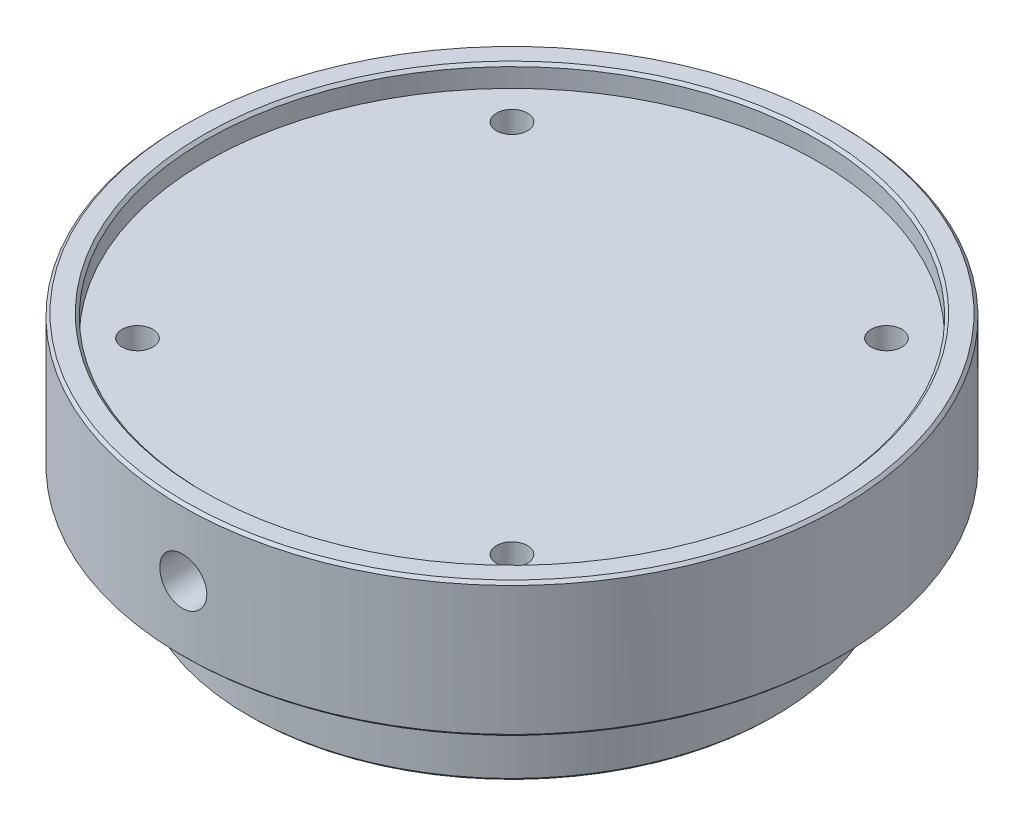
ISO-10303-21;
HEADER;
FILE_DESCRIPTION(('STEP AP214'),'2;1');
FILE_NAME('part.step','',(''),(''),'','','');
FILE_SCHEMA(('AUTOMOTIVE_DESIGN { 1 0 10303 214 1 1 1 1 }'));
ENDSEC;
DATA;
#1=APPLICATION_CONTEXT('core data for automotive mechanical design processes');
#2=APPLICATION_PROTOCOL_DEFINITION('international standard','automotive_design',2000,#1);
#3=PRODUCT_CONTEXT('',#1,'mechanical');
#4=PRODUCT('Part','Part','',(#3));
#5=PRODUCT_RELATED_PRODUCT_CATEGORY('part','',(#4));
#6=PRODUCT_DEFINITION_FORMATION('','',#4);
#7=PRODUCT_DEFINITION_CONTEXT('part definition',#1,'design');
#8=PRODUCT_DEFINITION('design','',#6,#7);
#9=PRODUCT_DEFINITION_SHAPE('','',#8);
#10=(LENGTH_UNIT() NAMED_UNIT(*) SI_UNIT(.MILLI.,.METRE.));
#11=(NAMED_UNIT(*) PLANE_ANGLE_UNIT() SI_UNIT($,.RADIAN.));
#12=(NAMED_UNIT(*) SI_UNIT($,.STERADIAN.) SOLID_ANGLE_UNIT());
#13=UNCERTAINTY_MEASURE_WITH_UNIT(LENGTH_MEASURE(1.E-05),#10,'distance_accuracy_value','');
#14=(GEOMETRIC_REPRESENTATION_CONTEXT(3) GLOBAL_UNCERTAINTY_ASSIGNED_CONTEXT((#13)) GLOBAL_UNIT_ASSIGNED_CONTEXT((#10,
#11,#12)) REPRESENTATION_CONTEXT('',''));
#15=CARTESIAN_POINT('',(0.,0.,0.));
#16=DIRECTION('',(0.,0.,1.));
#17=DIRECTION('',(1.,0.,0.));
#18=AXIS2_PLACEMENT_3D('',#15,#16,#17);
#19=CARTESIAN_POINT('',(35.56,-29.591,0.));
#20=DIRECTION('',(0.,1.,0.));
#21=DIRECTION('',(-1.,0.,0.));
#22=AXIS2_PLACEMENT_3D('',#19,#20,#21);
#23=PLANE('',#22);
#24=CARTESIAN_POINT('',(0.,-29.591,0.));
#25=DIRECTION('',(0.,1.,0.));
#26=DIRECTION('',(-1.,0.,0.));
#27=AXIS2_PLACEMENT_3D('',#24,#25,#26);
#28=CIRCLE('',#27,35.179);
#29=CARTESIAN_POINT('',(-35.179,-29.591,0.));
#30=VERTEX_POINT('',#29);
#31=EDGE_CURVE('E159',#30,#30,#28,.F.);
#32=ORIENTED_EDGE('',*,*,#31,.T.);
#33=EDGE_LOOP('',(#32));
#34=FACE_BOUND('',#33,.T.);
#35=ADVANCED_FACE('F30',(#34),#23,.F.);
#36=CARTESIAN_POINT('',(0.,-2.921,0.));
#37=DIRECTION('',(0.,-1.,0.));
#38=DIRECTION('',(1.,0.,0.));
#39=AXIS2_PLACEMENT_3D('',#36,#37,#38);
#40=PLANE('',#39);
#41=CARTESIAN_POINT('',(-25.256970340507,-2.92100000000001,-25.2569703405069));
#42=DIRECTION('',(0.,1.,0.));
#43=DIRECTION('',(0.,0.,1.));
#44=AXIS2_PLACEMENT_3D('',#41,#42,#43);
#45=CIRCLE('',#44,2.0828);
#46=CARTESIAN_POINT('',(-25.256970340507,-2.92100000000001,-23.1741703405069));
#47=VERTEX_POINT('',#46);
#48=EDGE_CURVE('E96',#47,#47,#45,.T.);
#49=ORIENTED_EDGE('',*,*,#48,.F.);
#50=EDGE_LOOP('',(#49));
#51=FACE_BOUND('',#50,.T.);
#52=CARTESIAN_POINT('',(-25.2569703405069,-2.92100000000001,25.256970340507));
#53=DIRECTION('',(0.,1.,0.));
#54=DIRECTION('',(0.,0.,1.));
#55=AXIS2_PLACEMENT_3D('',#52,#53,#54);
#56=CIRCLE('',#55,2.0828);
#57=CARTESIAN_POINT('',(-25.2569703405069,-2.92100000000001,27.339770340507));
#58=VERTEX_POINT('',#57);
#59=EDGE_CURVE('E108',#58,#58,#56,.T.);
#60=ORIENTED_EDGE('',*,*,#59,.F.);
#61=EDGE_LOOP('',(#60));
#62=FACE_BOUND('',#61,.T.);
#63=CARTESIAN_POINT('',(25.2569703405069,-2.921,-25.2569703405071));
#64=DIRECTION('',(0.,1.,0.));
#65=DIRECTION('',(0.,0.,1.));
#66=AXIS2_PLACEMENT_3D('',#63,#64,#65);
#67=CIRCLE('',#66,2.0828);
#68=CARTESIAN_POINT('',(25.2569703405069,-2.921,-23.1741703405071));
#69=VERTEX_POINT('',#68);
#70=EDGE_CURVE('E120',#69,#69,#67,.T.);
#71=ORIENTED_EDGE('',*,*,#70,.F.);
#72=EDGE_LOOP('',(#71));
#73=FACE_BOUND('',#72,.T.);
#74=CARTESIAN_POINT('',(25.256970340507,-2.921,25.2569703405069));
#75=DIRECTION('',(0.,1.,0.));
#76=DIRECTION('',(0.,0.,1.));
#77=AXIS2_PLACEMENT_3D('',#74,#75,#76);
#78=CIRCLE('',#77,2.0828);
#79=CARTESIAN_POINT('',(25.256970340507,-2.921,27.3397703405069));
#80=VERTEX_POINT('',#79);
#81=EDGE_CURVE('E132',#80,#80,#78,.T.);
#82=ORIENTED_EDGE('',*,*,#81,.F.);
#83=EDGE_LOOP('',(#82));
#84=FACE_BOUND('',#83,.T.);
#85=CARTESIAN_POINT('',(0.,-2.92100000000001,0.));
#86=DIRECTION('',(0.,1.,0.));
#87=DIRECTION('',(-1.,0.,0.));
#88=AXIS2_PLACEMENT_3D('',#85,#86,#87);
#89=CIRCLE('',#88,41.275);
#90=CARTESIAN_POINT('',(-41.275,-2.92100000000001,0.));
#91=VERTEX_POINT('',#90);
#92=EDGE_CURVE('E138',#91,#91,#89,.T.);
#93=ORIENTED_EDGE('',*,*,#92,.T.);
#94=EDGE_LOOP('',(#93));
#95=FACE_BOUND('',#94,.T.);
#96=ADVANCED_FACE('F256',(#51,#62,#73,#84,#95),#40,.F.);
#97=CARTESIAN_POINT('',(0.,0.,0.));
#98=DIRECTION('',(0.,1.,0.));
#99=DIRECTION('',(-1.,0.,0.));
#100=AXIS2_PLACEMENT_3D('',#97,#98,#99);
#101=CYLINDRICAL_SURFACE('',#100,41.275);
#102=CARTESIAN_POINT('',(0.,-0.38099999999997,0.));
#103=DIRECTION('',(0.,-1.,0.));
#104=DIRECTION('',(1.,0.,0.));
#105=AXIS2_PLACEMENT_3D('',#102,#103,#104);
#106=CIRCLE('',#105,41.275);
#107=CARTESIAN_POINT('',(41.275,-0.380999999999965,0.));
#108=VERTEX_POINT('',#107);
#109=EDGE_CURVE('E141',#108,#108,#106,.F.);
#110=ORIENTED_EDGE('',*,*,#109,.T.);
#111=EDGE_LOOP('',(#110));
#112=FACE_BOUND('',#111,.T.);
#113=ORIENTED_EDGE('',*,*,#92,.F.);
#114=EDGE_LOOP('',(#113));
#115=FACE_BOUND('',#114,.T.);
#116=ADVANCED_FACE('F262',(#112,#115),#101,.F.);
#117=CARTESIAN_POINT('',(41.275,0.,0.));
#118=DIRECTION('',(0.,-1.,0.));
#119=DIRECTION('',(1.,0.,0.));
#120=AXIS2_PLACEMENT_3D('',#117,#118,#119);
#121=PLANE('',#120);
#122=CARTESIAN_POINT('',(0.,0.,0.));
#123=DIRECTION('',(0.,-1.,0.));
#124=DIRECTION('',(1.,0.,0.));
#125=AXIS2_PLACEMENT_3D('',#122,#123,#124);
#126=CIRCLE('',#125,41.656);
#127=CARTESIAN_POINT('',(41.656,0.,0.));
#128=VERTEX_POINT('',#127);
#129=EDGE_CURVE('E147',#128,#128,#126,.T.);
#130=ORIENTED_EDGE('',*,*,#129,.T.);
#131=EDGE_LOOP('',(#130));
#132=FACE_BOUND('',#131,.T.);
#133=CARTESIAN_POINT('',(0.,0.,0.));
#134=DIRECTION('',(0.,-1.,0.));
#135=DIRECTION('',(1.,0.,0.));
#136=AXIS2_PLACEMENT_3D('',#133,#134,#135);
#137=CIRCLE('',#136,44.069);
#138=CARTESIAN_POINT('',(44.069,0.,0.));
#139=VERTEX_POINT('',#138);
#140=EDGE_CURVE('E144',#139,#139,#137,.F.);
#141=ORIENTED_EDGE('',*,*,#140,.T.);
#142=EDGE_LOOP('',(#141));
#143=FACE_BOUND('',#142,.T.);
#144=ADVANCED_FACE('F252',(#132,#143),#121,.F.);
#145=CARTESIAN_POINT('',(0.,0.,0.));
#146=DIRECTION('',(0.,1.,0.));
#147=DIRECTION('',(-1.,0.,0.));
#148=AXIS2_PLACEMENT_3D('',#145,#146,#147);
#149=CYLINDRICAL_SURFACE('',#148,44.45);
#150=CARTESIAN_POINT('',(0.,-5.90550000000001,-44.45));
#151=CARTESIAN_POINT('',(-0.178097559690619,-5.90550781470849,-44.4499985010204));
#152=CARTESIAN_POINT('',(-0.356318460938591,-5.92053560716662,-44.4489181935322));
#153=CARTESIAN_POINT('',(-0.707835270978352,-5.98026655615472,-44.4447124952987));
#154=CARTESIAN_POINT('',(-0.88112526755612,-6.02500389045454,-44.4415847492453));
#155=CARTESIAN_POINT('',(-1.21763791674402,-6.14285894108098,-44.4336378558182));
#156=CARTESIAN_POINT('',(-1.38086597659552,-6.21596125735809,-44.4288196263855));
#157=CARTESIAN_POINT('',(-1.69269346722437,-6.38844515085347,-44.418033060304));
#158=CARTESIAN_POINT('',(-1.84129615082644,-6.48782086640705,-44.4120649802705));
#159=CARTESIAN_POINT('',(-2.11997998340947,-6.71023731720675,-44.3996363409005));
#160=CARTESIAN_POINT('',(-2.25002939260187,-6.83331777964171,-44.3931749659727));
#161=CARTESIAN_POINT('',(-2.48764317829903,-7.09956696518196,-44.380494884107));
#162=CARTESIAN_POINT('',(-2.59520659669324,-7.24273654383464,-44.3742761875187));
#163=CARTESIAN_POINT('',(-2.78489768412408,-7.5452858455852,-44.3627762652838));
#164=CARTESIAN_POINT('',(-2.86699822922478,-7.7046826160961,-44.3574960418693));
#165=CARTESIAN_POINT('',(-3.00325964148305,-8.03504240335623,-44.3484793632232));
#166=CARTESIAN_POINT('',(-3.0574208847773,-8.20600526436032,-44.3447428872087));
#167=CARTESIAN_POINT('',(-3.1361761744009,-8.55433219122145,-44.3392430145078));
#168=CARTESIAN_POINT('',(-3.16082095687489,-8.73168473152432,-44.337476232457));
#169=CARTESIAN_POINT('',(-3.180000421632,-9.08801738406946,-44.3361048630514));
#170=CARTESIAN_POINT('',(-3.17453553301,-9.26699747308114,-44.3365002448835));
#171=CARTESIAN_POINT('',(-3.13369280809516,-9.62115815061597,-44.3394054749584));
#172=CARTESIAN_POINT('',(-3.09836996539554,-9.79634511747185,-44.3419114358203));
#173=CARTESIAN_POINT('',(-2.99889937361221,-10.1382970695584,-44.3487493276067));
#174=CARTESIAN_POINT('',(-2.93475140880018,-10.3050619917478,-44.3530812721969));
#175=CARTESIAN_POINT('',(-2.77938940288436,-10.625612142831,-44.3630874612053));
#176=CARTESIAN_POINT('',(-2.68815052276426,-10.7793852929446,-44.3687629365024));
#177=CARTESIAN_POINT('',(-2.4812145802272,-11.0694547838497,-44.3808154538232));
#178=CARTESIAN_POINT('',(-2.36551715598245,-11.2057508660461,-44.3871925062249));
#179=CARTESIAN_POINT('',(-2.11263912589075,-11.4573171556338,-44.3999468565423));
#180=CARTESIAN_POINT('',(-1.97541094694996,-11.572539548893,-44.4063241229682));
#181=CARTESIAN_POINT('',(-1.68353326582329,-11.7783185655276,-44.4183465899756));
#182=CARTESIAN_POINT('',(-1.52888375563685,-11.8688751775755,-44.4239917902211));
#183=CARTESIAN_POINT('',(-1.20652351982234,-12.0227484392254,-44.4339147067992));
#184=CARTESIAN_POINT('',(-1.03881186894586,-12.086063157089,-44.4381923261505));
#185=CARTESIAN_POINT('',(-0.695101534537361,-12.1836228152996,-44.4448968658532));
#186=CARTESIAN_POINT('',(-0.51910297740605,-12.2178681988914,-44.4473238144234));
#187=CARTESIAN_POINT('',(-0.164229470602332,-12.2562575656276,-44.4500499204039));
#188=CARTESIAN_POINT('',(0.0146382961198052,-12.2604676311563,-44.4503537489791));
#189=CARTESIAN_POINT('',(0.370537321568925,-12.2388396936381,-44.4488118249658));
#190=CARTESIAN_POINT('',(0.547568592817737,-12.2130018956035,-44.4469660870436));
#191=CARTESIAN_POINT('',(0.894582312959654,-12.132066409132,-44.4413357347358));
#192=CARTESIAN_POINT('',(1.06457189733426,-12.0769991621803,-44.4375531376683));
#193=CARTESIAN_POINT('',(1.39289741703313,-11.9391989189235,-44.4284743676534));
#194=CARTESIAN_POINT('',(1.55123321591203,-11.8564655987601,-44.423178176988));
#195=CARTESIAN_POINT('',(1.85205847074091,-11.6655143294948,-44.4116551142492));
#196=CARTESIAN_POINT('',(1.99451993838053,-11.5572523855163,-44.4054266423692));
#197=CARTESIAN_POINT('',(2.25927051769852,-11.3183808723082,-44.3927448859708));
#198=CARTESIAN_POINT('',(2.38155937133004,-11.187771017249,-44.3862915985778));
#199=CARTESIAN_POINT('',(2.60271836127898,-10.907625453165,-44.3738738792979));
#200=CARTESIAN_POINT('',(2.70154552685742,-10.7580557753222,-44.3679103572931));
#201=CARTESIAN_POINT('',(2.87268159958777,-10.4444063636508,-44.3571593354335));
#202=CARTESIAN_POINT('',(2.94499071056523,-10.280326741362,-44.3523718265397));
#203=CARTESIAN_POINT('',(3.06096414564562,-9.94247011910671,-44.3445193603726));
#204=CARTESIAN_POINT('',(3.10465522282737,-9.76870234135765,-44.3414527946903));
#205=CARTESIAN_POINT('',(3.16223963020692,-9.41627466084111,-44.3373836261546));
#206=CARTESIAN_POINT('',(3.17613336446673,-9.23761482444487,-44.3363809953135));
#207=CARTESIAN_POINT('',(3.1737245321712,-8.88090165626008,-44.3365534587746));
#208=CARTESIAN_POINT('',(3.15748950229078,-8.7028478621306,-44.3377236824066));
#209=CARTESIAN_POINT('',(3.09542433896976,-8.35200183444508,-44.3420996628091));
#210=CARTESIAN_POINT('',(3.04959415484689,-8.17920960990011,-44.3453054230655));
#211=CARTESIAN_POINT('',(2.92965566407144,-7.8437839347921,-44.353390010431));
#212=CARTESIAN_POINT('',(2.85554804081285,-7.68115023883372,-44.3582687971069));
#213=CARTESIAN_POINT('',(2.6811666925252,-7.37062317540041,-44.3691496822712));
#214=CARTESIAN_POINT('',(2.58089353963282,-7.22272948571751,-44.375151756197));
#215=CARTESIAN_POINT('',(2.35677531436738,-6.94553630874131,-44.3876187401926));
#216=CARTESIAN_POINT('',(2.23288076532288,-6.81627686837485,-44.3940846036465));
#217=CARTESIAN_POINT('',(1.96511570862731,-6.58034220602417,-44.4067421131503));
#218=CARTESIAN_POINT('',(1.82124034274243,-6.47367249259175,-44.412933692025));
#219=CARTESIAN_POINT('',(1.51738984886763,-6.28584173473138,-44.4243532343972));
#220=CARTESIAN_POINT('',(1.35739121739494,-6.20471866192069,-44.429579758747));
#221=CARTESIAN_POINT('',(1.02612043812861,-6.07058916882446,-44.4384621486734));
#222=CARTESIAN_POINT('',(0.854861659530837,-6.01755005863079,-44.4421198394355));
#223=CARTESIAN_POINT('',(0.568807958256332,-5.95477057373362,-44.4465015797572));
#224=CARTESIAN_POINT('',(0.455858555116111,-5.93631826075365,-44.4478076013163));
#225=CARTESIAN_POINT('',(0.228623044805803,-5.9116804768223,-44.4495572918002));
#226=CARTESIAN_POINT('',(0.114336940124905,-5.90549498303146,-44.4500009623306));
#227=CARTESIAN_POINT('',(0.,-5.90550000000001,-44.45));
#228=B_SPLINE_CURVE_WITH_KNOTS('',3,(#150,#151,#152,#153,#154,#155,#156,#157,#158,#159,#160,
#161,#162,#163,#164,#165,#166,#167,#168,#169,#170,#171,#172,#173,#174,#175,#176,#177,#178,#179,
#180,#181,#182,#183,#184,#185,#186,#187,#188,#189,#190,#191,#192,#193,#194,#195,#196,#197,#198,
#199,#200,#201,#202,#203,#204,#205,#206,#207,#208,#209,#210,#211,#212,#213,#214,#215,#216,#217,
#218,#219,#220,#221,#222,#223,#224,#225,#226,#227),.UNSPECIFIED.,.T.,.F.,(4,2,2,2,2,2,2,2,2,2,2,
2,2,2,2,2,2,2,2,2,2,2,2,2,2,2,2,2,2,2,2,2,2,2,2,2,2,2,4),(0.,0.53387525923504,1.06836575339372,
1.60256646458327,2.13664809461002,2.67163271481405,3.20664012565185,3.74221550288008,
4.27778366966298,4.81242991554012,5.34706854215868,5.88072458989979,6.41438463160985,
6.94853549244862,7.48269425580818,8.01805033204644,8.55340665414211,9.08880093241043,
9.62418704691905,10.1583948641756,10.6925990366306,11.2262479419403,11.7599030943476,
12.2944847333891,12.8290732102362,13.3646333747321,13.9001894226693,14.4352440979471,
14.9702915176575,15.5041410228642,16.0379914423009,16.571828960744,17.105654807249,
17.6406113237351,18.1756981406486,18.7115765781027,19.2468298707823,19.5895733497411,
19.9323161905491),.UNSPECIFIED.);
#229=CARTESIAN_POINT('',(0.,-5.90550000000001,-44.45));
#230=VERTEX_POINT('',#229);
#231=EDGE_CURVE('E11',#230,#230,#228,.T.);
#232=ORIENTED_EDGE('',*,*,#231,.T.);
#233=EDGE_LOOP('',(#232));
#234=FACE_BOUND('',#233,.T.);
#235=CARTESIAN_POINT('',(3.175,-9.0805,44.3364621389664));
#236=CARTESIAN_POINT('',(3.17499218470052,-9.25859690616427,44.3364636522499));
#237=CARTESIAN_POINT('',(3.15996449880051,-9.43681715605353,44.3375467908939));
#238=CARTESIAN_POINT('',(3.10023401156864,-9.78833261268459,44.3417626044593));
#239=CARTESIAN_POINT('',(3.05549703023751,-9.96162190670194,44.3448976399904));
#240=CARTESIAN_POINT('',(2.93764301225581,-10.298133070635,44.3528603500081));
#241=CARTESIAN_POINT('',(2.86454139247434,-10.4613603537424,44.3576871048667));
#242=CARTESIAN_POINT('',(2.69205913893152,-10.7731865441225,44.3684882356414));
#243=CARTESIAN_POINT('',(2.5926843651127,-10.9217887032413,44.374462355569));
#244=CARTESIAN_POINT('',(2.37026886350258,-11.2004731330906,44.3868980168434));
#245=CARTESIAN_POINT('',(2.24718819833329,-11.3305234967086,44.3933603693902));
#246=CARTESIAN_POINT('',(1.98093820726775,-11.5681391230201,44.4060368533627));
#247=CARTESIAN_POINT('',(1.83776802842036,-11.6757034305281,44.4122509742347));
#248=CARTESIAN_POINT('',(1.53521820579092,-11.8653954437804,44.4237381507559));
#249=CARTESIAN_POINT('',(1.37582161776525,-11.9474961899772,44.4290102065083));
#250=CARTESIAN_POINT('',(1.04546222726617,-12.0837580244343,44.4380105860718));
#251=CARTESIAN_POINT('',(0.874499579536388,-12.1379194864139,44.4417389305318));
#252=CARTESIAN_POINT('',(0.526173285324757,-12.2166752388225,44.4472261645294));
#253=CARTESIAN_POINT('',(0.348821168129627,-12.2413202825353,44.4489884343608));
#254=CARTESIAN_POINT('',(-0.00751065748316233,-12.2605004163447,44.4503563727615));
#255=CARTESIAN_POINT('',(-0.18649034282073,-12.2550359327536,44.449962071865));
#256=CARTESIAN_POINT('',(-0.540652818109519,-12.2141938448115,44.4470641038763));
#257=CARTESIAN_POINT('',(-0.715841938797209,-12.1788708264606,44.4445642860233));
#258=CARTESIAN_POINT('',(-1.05779810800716,-12.0793991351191,44.4377410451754));
#259=CARTESIAN_POINT('',(-1.22456509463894,-12.0152502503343,44.4334176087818));
#260=CARTESIAN_POINT('',(-1.54511773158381,-11.8598863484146,44.4234271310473));
#261=CARTESIAN_POINT('',(-1.69889140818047,-11.7686467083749,44.4177588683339));
#262=CARTESIAN_POINT('',(-1.9889616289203,-11.5617091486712,44.4057162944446));
#263=CARTESIAN_POINT('',(-2.12525791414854,-11.4460108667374,44.3993419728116));
#264=CARTESIAN_POINT('',(-2.37682321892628,-11.1931322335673,44.3865874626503));
#265=CARTESIAN_POINT('',(-2.49204459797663,-11.0559044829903,44.3802072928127));
#266=CARTESIAN_POINT('',(-2.69782177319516,-10.7640280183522,44.3681745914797));
#267=CARTESIAN_POINT('',(-2.78837755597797,-10.6093792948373,44.3625220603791));
#268=CARTESIAN_POINT('',(-2.9422502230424,-10.2870192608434,44.352583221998));
#269=CARTESIAN_POINT('',(-3.00556491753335,-10.1193069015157,44.348297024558));
#270=CARTESIAN_POINT('',(-3.10312431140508,-9.77559502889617,44.3415779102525));
#271=CARTESIAN_POINT('',(-3.13736945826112,-9.59959564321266,44.3391449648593));
#272=CARTESIAN_POINT('',(-3.17575793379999,-9.24472176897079,44.3364121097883));
#273=CARTESIAN_POINT('',(-3.17996756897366,-9.06585448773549,44.3361075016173));
#274=CARTESIAN_POINT('',(-3.15833894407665,-8.70995653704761,44.3376533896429));
#275=CARTESIAN_POINT('',(-3.13250088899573,-8.53292585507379,44.3395038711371));
#276=CARTESIAN_POINT('',(-3.0515654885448,-8.18591497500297,44.3451471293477));
#277=CARTESIAN_POINT('',(-2.99649884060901,-8.01592758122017,44.3489378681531));
#278=CARTESIAN_POINT('',(-2.85870053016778,-7.68760617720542,44.3580327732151));
#279=CARTESIAN_POINT('',(-2.77596854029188,-7.52927230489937,44.3633369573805));
#280=CARTESIAN_POINT('',(-2.58501921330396,-7.2284483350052,44.3748724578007));
#281=CARTESIAN_POINT('',(-2.4767575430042,-7.08598644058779,44.3811053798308));
#282=CARTESIAN_POINT('',(-2.23788633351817,-6.82123487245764,44.3937904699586));
#283=CARTESIAN_POINT('',(-2.10727651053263,-6.69894545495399,44.4002426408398));
#284=CARTESIAN_POINT('',(-1.82713069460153,-6.47778528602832,44.4126530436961));
#285=CARTESIAN_POINT('',(-1.67756072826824,-6.37895751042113,44.4186103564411));
#286=CARTESIAN_POINT('',(-1.36391058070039,-6.20782036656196,44.4293465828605));
#287=CARTESIAN_POINT('',(-1.19983051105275,-6.13551079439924,44.4341255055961));
#288=CARTESIAN_POINT('',(-0.861974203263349,-6.01953704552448,44.4419621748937));
#289=CARTESIAN_POINT('',(-0.688207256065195,-5.97584591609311,44.4450215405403));
#290=CARTESIAN_POINT('',(-0.335781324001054,-5.91826112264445,44.4490808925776));
#291=CARTESIAN_POINT('',(-0.157122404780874,-5.90436705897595,44.4500809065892));
#292=CARTESIAN_POINT('',(0.199591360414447,-5.90677494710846,44.4499089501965));
#293=CARTESIAN_POINT('',(0.37764666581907,-5.92300975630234,44.4487418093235));
#294=CARTESIAN_POINT('',(0.728495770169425,-5.98507501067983,44.444376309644));
#295=CARTESIAN_POINT('',(0.901289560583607,-6.03090550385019,44.441177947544));
#296=CARTESIAN_POINT('',(1.23671831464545,-6.15084518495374,44.4331092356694));
#297=CARTESIAN_POINT('',(1.39935352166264,-6.22495369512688,44.4282389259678));
#298=CARTESIAN_POINT('',(1.70988323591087,-6.39933728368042,44.4173723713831));
#299=CARTESIAN_POINT('',(1.8577780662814,-6.49961178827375,44.4113761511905));
#300=CARTESIAN_POINT('',(2.13497113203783,-6.72373148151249,44.3989157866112));
#301=CARTESIAN_POINT('',(2.26422956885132,-6.84762583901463,44.392450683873));
#302=CARTESIAN_POINT('',(2.50016229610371,-7.11539010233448,44.3797891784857));
#303=CARTESIAN_POINT('',(2.60683107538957,-7.25926486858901,44.3735928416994));
#304=CARTESIAN_POINT('',(2.79466084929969,-7.56311489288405,44.362160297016));
#305=CARTESIAN_POINT('',(2.87578369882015,-7.7231137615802,44.3569255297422));
#306=CARTESIAN_POINT('',(3.00991270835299,-8.05438504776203,44.3480268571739));
#307=CARTESIAN_POINT('',(3.06295156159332,-8.22564409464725,44.3443611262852));
#308=CARTESIAN_POINT('',(3.12573030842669,-8.51169710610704,44.3399692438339));
#309=CARTESIAN_POINT('',(3.14418228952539,-8.62464549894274,44.338660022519));
#310=CARTESIAN_POINT('',(3.16881963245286,-8.85187898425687,44.3369059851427));
#311=CARTESIAN_POINT('',(3.17500501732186,-8.96616407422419,44.3364611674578));
#312=CARTESIAN_POINT('',(3.175,-9.0805,44.3364621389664));
#313=B_SPLINE_CURVE_WITH_KNOTS('',3,(#235,#236,#237,#238,#239,#240,#241,#242,#243,#244,#245,
#246,#247,#248,#249,#250,#251,#252,#253,#254,#255,#256,#257,#258,#259,#260,#261,#262,#263,#264,
#265,#266,#267,#268,#269,#270,#271,#272,#273,#274,#275,#276,#277,#278,#279,#280,#281,#282,#283,
#284,#285,#286,#287,#288,#289,#290,#291,#292,#293,#294,#295,#296,#297,#298,#299,#300,#301,#302,
#303,#304,#305,#306,#307,#308,#309,#310,#311,#312),.UNSPECIFIED.,.T.,.F.,(4,2,2,2,2,2,2,2,2,2,2,
2,2,2,2,2,2,2,2,2,2,2,2,2,2,2,2,2,2,2,2,2,2,2,2,2,2,2,4),(0.,0.533873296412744,1.06836187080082,
1.6025603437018,2.13663976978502,2.67162695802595,3.20663686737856,3.74221129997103,
4.27777856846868,4.81242360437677,5.34706107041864,5.88072324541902,6.41438934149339,
6.94854198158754,7.48270253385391,8.01805603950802,8.55340983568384,9.08880665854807,
9.62419523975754,10.1584015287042,10.6926041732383,11.226246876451,11.7598958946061,
12.2944785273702,12.8290679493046,13.3646291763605,13.9001862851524,14.4352382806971,
14.9702830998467,15.5041369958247,16.0379917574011,16.5718337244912,17.1056639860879,
17.6406178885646,18.1757021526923,18.7115816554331,19.2468359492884,19.5895763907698,
19.9323161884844),.UNSPECIFIED.);
#314=CARTESIAN_POINT('',(3.175,-9.0805,44.3364621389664));
#315=VERTEX_POINT('',#314);
#316=EDGE_CURVE('E42',#315,#315,#313,.T.);
#317=ORIENTED_EDGE('',*,*,#316,.T.);
#318=EDGE_LOOP('',(#317));
#319=FACE_BOUND('',#318,.T.);
#320=CARTESIAN_POINT('',(0.,-0.381000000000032,0.));
#321=DIRECTION('',(0.,-1.,0.));
#322=DIRECTION('',(1.,0.,0.));
#323=AXIS2_PLACEMENT_3D('',#320,#321,#322);
#324=CIRCLE('',#323,44.45);
#325=CARTESIAN_POINT('',(44.45,-0.381000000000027,0.));
#326=VERTEX_POINT('',#325);
#327=EDGE_CURVE('E153',#326,#326,#324,.T.);
#328=ORIENTED_EDGE('',*,*,#327,.T.);
#329=EDGE_LOOP('',(#328));
#330=FACE_BOUND('',#329,.T.);
#331=CARTESIAN_POINT('',(0.,-17.78,0.));
#332=DIRECTION('',(0.,1.,0.));
#333=DIRECTION('',(-1.,0.,0.));
#334=AXIS2_PLACEMENT_3D('',#331,#332,#333);
#335=CIRCLE('',#334,44.45);
#336=CARTESIAN_POINT('',(-44.45,-17.78,0.));
#337=VERTEX_POINT('',#336);
#338=EDGE_CURVE('E150',#337,#337,#335,.T.);
#339=ORIENTED_EDGE('',*,*,#338,.T.);
#340=EDGE_LOOP('',(#339));
#341=FACE_BOUND('',#340,.T.);
#342=ADVANCED_FACE('F168',(#234,#319,#330,#341),#149,.T.);
#343=CARTESIAN_POINT('',(44.45,-18.161,0.));
#344=DIRECTION('',(0.,1.,0.));
#345=DIRECTION('',(-1.,0.,0.));
#346=AXIS2_PLACEMENT_3D('',#343,#344,#345);
#347=PLANE('',#346);
#348=CARTESIAN_POINT('',(0.,-18.161,0.));
#349=DIRECTION('',(0.,1.,0.));
#350=DIRECTION('',(-1.,0.,0.));
#351=AXIS2_PLACEMENT_3D('',#348,#349,#350);
#352=CIRCLE('',#351,44.069);
#353=CARTESIAN_POINT('',(-44.069,-18.161,0.));
#354=VERTEX_POINT('',#353);
#355=EDGE_CURVE('E162',#354,#354,#352,.F.);
#356=ORIENTED_EDGE('',*,*,#355,.T.);
#357=EDGE_LOOP('',(#356));
#358=FACE_BOUND('',#357,.T.);
#359=CARTESIAN_POINT('',(0.,-18.161,0.));
#360=DIRECTION('',(0.,1.,0.));
#361=DIRECTION('',(-1.,0.,0.));
#362=AXIS2_PLACEMENT_3D('',#359,#360,#361);
#363=CIRCLE('',#362,35.56);
#364=CARTESIAN_POINT('',(-35.56,-18.161,0.));
#365=VERTEX_POINT('',#364);
#366=EDGE_CURVE('E135',#365,#365,#363,.T.);
#367=ORIENTED_EDGE('',*,*,#366,.T.);
#368=EDGE_LOOP('',(#367));
#369=FACE_BOUND('',#368,.T.);
#370=ADVANCED_FACE('F245',(#358,#369),#347,.F.);
#371=CARTESIAN_POINT('',(0.,0.,0.));
#372=DIRECTION('',(0.,1.,0.));
#373=DIRECTION('',(-1.,0.,0.));
#374=AXIS2_PLACEMENT_3D('',#371,#372,#373);
#375=CYLINDRICAL_SURFACE('',#374,35.56);
#376=CARTESIAN_POINT('',(0.,-29.21,0.));
#377=DIRECTION('',(0.,1.,0.));
#378=DIRECTION('',(-1.,0.,0.));
#379=AXIS2_PLACEMENT_3D('',#376,#377,#378);
#380=CIRCLE('',#379,35.56);
#381=CARTESIAN_POINT('',(-35.56,-29.21,0.));
#382=VERTEX_POINT('',#381);
#383=EDGE_CURVE('E156',#382,#382,#380,.T.);
#384=ORIENTED_EDGE('',*,*,#383,.T.);
#385=EDGE_LOOP('',(#384));
#386=FACE_BOUND('',#385,.T.);
#387=ORIENTED_EDGE('',*,*,#366,.F.);
#388=EDGE_LOOP('',(#387));
#389=FACE_BOUND('',#388,.T.);
#390=ADVANCED_FACE('F242',(#386,#389),#375,.T.);
#391=CARTESIAN_POINT('',(0.,-0.38099999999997,0.));
#392=DIRECTION('',(0.,1.,0.));
#393=DIRECTION('',(-1.,0.,0.));
#394=AXIS2_PLACEMENT_3D('',#391,#392,#393);
#395=CONICAL_SURFACE('',#394,41.275,0.785398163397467);
#396=ORIENTED_EDGE('',*,*,#129,.F.);
#397=EDGE_LOOP('',(#396));
#398=FACE_BOUND('',#397,.T.);
#399=ORIENTED_EDGE('',*,*,#109,.F.);
#400=EDGE_LOOP('',(#399));
#401=FACE_BOUND('',#400,.T.);
#402=ADVANCED_FACE('F244',(#398,#401),#395,.F.);
#403=CARTESIAN_POINT('',(0.,0.,0.));
#404=DIRECTION('',(0.,-1.,0.));
#405=DIRECTION('',(1.,0.,0.));
#406=AXIS2_PLACEMENT_3D('',#403,#404,#405);
#407=CONICAL_SURFACE('',#406,44.069,0.785398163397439);
#408=ORIENTED_EDGE('',*,*,#327,.F.);
#409=EDGE_LOOP('',(#408));
#410=FACE_BOUND('',#409,.T.);
#411=ORIENTED_EDGE('',*,*,#140,.F.);
#412=EDGE_LOOP('',(#411));
#413=FACE_BOUND('',#412,.T.);
#414=ADVANCED_FACE('F269',(#410,#413),#407,.T.);
#415=CARTESIAN_POINT('',(0.,-29.21,0.));
#416=DIRECTION('',(0.,1.,0.));
#417=DIRECTION('',(-1.,0.,0.));
#418=AXIS2_PLACEMENT_3D('',#415,#416,#417);
#419=CONICAL_SURFACE('',#418,35.56,0.785398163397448);
#420=CARTESIAN_POINT('',(-35.179,-29.591,0.));
#421=CARTESIAN_POINT('',(-35.18296875,-29.58703125,0.));
#422=CARTESIAN_POINT('',(-35.1869375,-29.5830625,0.));
#423=CARTESIAN_POINT('',(-35.194875,-29.575125,0.));
#424=CARTESIAN_POINT('',(-35.19884375,-29.57115625,0.));
#425=CARTESIAN_POINT('',(-35.20678125,-29.56321875,0.));
#426=CARTESIAN_POINT('',(-35.21075,-29.55925,0.));
#427=CARTESIAN_POINT('',(-35.2186875,-29.5513125,0.));
#428=CARTESIAN_POINT('',(-35.22265625,-29.54734375,0.));
#429=CARTESIAN_POINT('',(-35.23059375,-29.53940625,0.));
#430=CARTESIAN_POINT('',(-35.2345625,-29.5354375,0.));
#431=CARTESIAN_POINT('',(-35.2425,-29.5275,0.));
#432=CARTESIAN_POINT('',(-35.24646875,-29.52353125,0.));
#433=CARTESIAN_POINT('',(-35.25440625,-29.51559375,0.));
#434=CARTESIAN_POINT('',(-35.258375,-29.511625,0.));
#435=CARTESIAN_POINT('',(-35.2663125,-29.5036875,0.));
#436=CARTESIAN_POINT('',(-35.27028125,-29.49971875,0.));
#437=CARTESIAN_POINT('',(-35.27821875,-29.49178125,0.));
#438=CARTESIAN_POINT('',(-35.2821875,-29.4878125,0.));
#439=CARTESIAN_POINT('',(-35.290125,-29.479875,0.));
#440=CARTESIAN_POINT('',(-35.29409375,-29.47590625,0.));
#441=CARTESIAN_POINT('',(-35.30203125,-29.46796875,0.));
#442=CARTESIAN_POINT('',(-35.306,-29.464,0.));
#443=CARTESIAN_POINT('',(-35.3139375,-29.4560625,0.));
#444=CARTESIAN_POINT('',(-35.31790625,-29.45209375,0.));
#445=CARTESIAN_POINT('',(-35.32584375,-29.44415625,0.));
#446=CARTESIAN_POINT('',(-35.3298125,-29.4401875,0.));
#447=CARTESIAN_POINT('',(-35.33775,-29.43225,0.));
#448=CARTESIAN_POINT('',(-35.34171875,-29.42828125,0.));
#449=CARTESIAN_POINT('',(-35.34965625,-29.42034375,0.));
#450=CARTESIAN_POINT('',(-35.353625,-29.416375,0.));
#451=CARTESIAN_POINT('',(-35.3615625,-29.4084375,0.));
#452=CARTESIAN_POINT('',(-35.36553125,-29.40446875,0.));
#453=CARTESIAN_POINT('',(-35.37346875,-29.39653125,0.));
#454=CARTESIAN_POINT('',(-35.3774375,-29.3925625,0.));
#455=CARTESIAN_POINT('',(-35.385375,-29.384625,0.));
#456=CARTESIAN_POINT('',(-35.38934375,-29.38065625,0.));
#457=CARTESIAN_POINT('',(-35.39728125,-29.37271875,0.));
#458=CARTESIAN_POINT('',(-35.40125,-29.36875,0.));
#459=CARTESIAN_POINT('',(-35.4091875,-29.3608125,0.));
#460=CARTESIAN_POINT('',(-35.41315625,-29.35684375,0.));
#461=CARTESIAN_POINT('',(-35.42109375,-29.34890625,0.));
#462=CARTESIAN_POINT('',(-35.4250625,-29.3449375,0.));
#463=CARTESIAN_POINT('',(-35.433,-29.337,0.));
#464=CARTESIAN_POINT('',(-35.43696875,-29.33303125,0.));
#465=CARTESIAN_POINT('',(-35.44490625,-29.32509375,0.));
#466=CARTESIAN_POINT('',(-35.448875,-29.321125,0.));
#467=CARTESIAN_POINT('',(-35.4568125,-29.3131875,0.));
#468=CARTESIAN_POINT('',(-35.46078125,-29.30921875,0.));
#469=CARTESIAN_POINT('',(-35.46871875,-29.30128125,0.));
#470=CARTESIAN_POINT('',(-35.4726875,-29.2973125,0.));
#471=CARTESIAN_POINT('',(-35.480625,-29.289375,0.));
#472=CARTESIAN_POINT('',(-35.48459375,-29.28540625,0.));
#473=CARTESIAN_POINT('',(-35.49253125,-29.27746875,0.));
#474=CARTESIAN_POINT('',(-35.4965,-29.2735,0.));
#475=CARTESIAN_POINT('',(-35.5044375,-29.2655625,0.));
#476=CARTESIAN_POINT('',(-35.50840625,-29.26159375,0.));
#477=CARTESIAN_POINT('',(-35.51634375,-29.25365625,0.));
#478=CARTESIAN_POINT('',(-35.5203125,-29.2496875,0.));
#479=CARTESIAN_POINT('',(-35.52825,-29.24175,0.));
#480=CARTESIAN_POINT('',(-35.53221875,-29.23778125,0.));
#481=CARTESIAN_POINT('',(-35.54015625,-29.22984375,0.));
#482=CARTESIAN_POINT('',(-35.544125,-29.225875,0.));
#483=CARTESIAN_POINT('',(-35.5520625,-29.2179375,0.));
#484=CARTESIAN_POINT('',(-35.55603125,-29.21396875,0.));
#485=CARTESIAN_POINT('',(-35.56,-29.21,0.));
#486=B_SPLINE_CURVE_WITH_KNOTS('',3,(#420,#421,#422,#423,#424,#425,#426,#427,#428,#429,#430,
#431,#432,#433,#434,#435,#436,#437,#438,#439,#440,#441,#442,#443,#444,#445,#446,#447,#448,#449,
#450,#451,#452,#453,#454,#455,#456,#457,#458,#459,#460,#461,#462,#463,#464,#465,#466,#467,#468,
#469,#470,#471,#472,#473,#474,#475,#476,#477,#478,#479,#480,#481,#482,#483,#484,#485),
.UNSPECIFIED.,.F.,.F.,(4,2,2,2,2,2,2,2,2,2,2,2,2,2,2,2,2,2,2,2,2,2,2,2,2,2,2,2,2,2,2,2,4),(0.,
0.0168379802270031,0.0336759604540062,0.0505139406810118,0.0673519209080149,0.0841899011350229,
0.101027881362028,0.117865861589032,0.134703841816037,0.15154182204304,0.168379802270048,
0.185217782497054,0.202055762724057,0.21889374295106,0.235731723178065,0.252569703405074,
0.269407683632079,0.286245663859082,0.303083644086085,0.319921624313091,0.336759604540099,
0.353597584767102,0.370435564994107,0.387273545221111,0.404111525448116,0.420949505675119,
0.437787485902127,0.454625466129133,0.471463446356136,0.488301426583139,0.505139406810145,
0.521977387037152,0.538815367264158),.UNSPECIFIED.);
#487=EDGE_CURVE('BSEAM272',#30,#382,#486,.T.);
#488=ORIENTED_EDGE('',*,*,#31,.F.);
#489=ORIENTED_EDGE('',*,*,#383,.F.);
#490=ORIENTED_EDGE('',*,*,#487,.T.);
#491=ORIENTED_EDGE('',*,*,#487,.F.);
#492=EDGE_LOOP('',(#488,#490,#489,#491));
#493=FACE_BOUND('',#492,.T.);
#494=ADVANCED_FACE('F272',(#493),#419,.T.);
#495=CARTESIAN_POINT('',(0.,-17.78,0.));
#496=DIRECTION('',(0.,1.,0.));
#497=DIRECTION('',(-1.,0.,0.));
#498=AXIS2_PLACEMENT_3D('',#495,#496,#497);
#499=CONICAL_SURFACE('',#498,44.45,0.785398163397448);
#500=ORIENTED_EDGE('',*,*,#355,.F.);
#501=EDGE_LOOP('',(#500));
#502=FACE_BOUND('',#501,.T.);
#503=ORIENTED_EDGE('',*,*,#338,.F.);
#504=EDGE_LOOP('',(#503));
#505=FACE_BOUND('',#504,.T.);
#506=ADVANCED_FACE('F32',(#502,#505),#499,.T.);
#507=CARTESIAN_POINT('',(25.256970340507,-2.921,25.2569703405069));
#508=DIRECTION('',(0.,1.,0.));
#509=DIRECTION('',(0.,0.,1.));
#510=AXIS2_PLACEMENT_3D('',#507,#508,#509);
#511=CYLINDRICAL_SURFACE('',#510,2.0828);
#512=CARTESIAN_POINT('',(25.256970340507,-12.573,25.2569703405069));
#513=DIRECTION('',(0.,1.,0.));
#514=DIRECTION('',(0.,0.,1.));
#515=AXIS2_PLACEMENT_3D('',#512,#513,#514);
#516=CIRCLE('',#515,2.0828);
#517=CARTESIAN_POINT('',(25.256970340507,-12.573,27.3397703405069));
#518=VERTEX_POINT('',#517);
#519=EDGE_CURVE('E129',#518,#518,#516,.T.);
#520=ORIENTED_EDGE('',*,*,#519,.F.);
#521=EDGE_LOOP('',(#520));
#522=FACE_BOUND('',#521,.T.);
#523=ORIENTED_EDGE('',*,*,#81,.T.);
#524=EDGE_LOOP('',(#523));
#525=FACE_BOUND('',#524,.T.);
#526=ADVANCED_FACE('F237',(#522,#525),#511,.F.);
#527=CARTESIAN_POINT('',(26.984170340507,-12.573,25.2569703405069));
#528=DIRECTION('',(0.,-1.,0.));
#529=DIRECTION('',(0.,0.,-1.));
#530=AXIS2_PLACEMENT_3D('',#527,#528,#529);
#531=PLANE('',#530);
#532=CARTESIAN_POINT('',(25.256970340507,-12.573,25.2569703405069));
#533=DIRECTION('',(0.,1.,0.));
#534=DIRECTION('',(0.,0.,1.));
#535=AXIS2_PLACEMENT_3D('',#532,#533,#534);
#536=CIRCLE('',#535,1.7272);
#537=CARTESIAN_POINT('',(25.256970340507,-12.573,26.9841703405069));
#538=VERTEX_POINT('',#537);
#539=EDGE_CURVE('E126',#538,#538,#536,.T.);
#540=ORIENTED_EDGE('',*,*,#539,.F.);
#541=EDGE_LOOP('',(#540));
#542=FACE_BOUND('',#541,.T.);
#543=ORIENTED_EDGE('',*,*,#519,.T.);
#544=EDGE_LOOP('',(#543));
#545=FACE_BOUND('',#544,.T.);
#546=ADVANCED_FACE('F233',(#542,#545),#531,.F.);
#547=CARTESIAN_POINT('',(25.256970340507,-2.921,25.2569703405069));
#548=DIRECTION('',(0.,1.,0.));
#549=DIRECTION('',(0.,0.,1.));
#550=AXIS2_PLACEMENT_3D('',#547,#548,#549);
#551=CYLINDRICAL_SURFACE('',#550,1.7272);
#552=CARTESIAN_POINT('',(25.256970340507,-14.351,25.2569703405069));
#553=DIRECTION('',(0.,1.,0.));
#554=DIRECTION('',(0.,0.,1.));
#555=AXIS2_PLACEMENT_3D('',#552,#553,#554);
#556=CIRCLE('',#555,1.7272);
#557=CARTESIAN_POINT('',(25.256970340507,-14.351,26.9841703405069));
#558=VERTEX_POINT('',#557);
#559=EDGE_CURVE('E123',#558,#558,#556,.T.);
#560=ORIENTED_EDGE('',*,*,#559,.F.);
#561=EDGE_LOOP('',(#560));
#562=FACE_BOUND('',#561,.T.);
#563=ORIENTED_EDGE('',*,*,#539,.T.);
#564=EDGE_LOOP('',(#563));
#565=FACE_BOUND('',#564,.T.);
#566=ADVANCED_FACE('F230',(#562,#565),#551,.F.);
#567=CARTESIAN_POINT('',(25.256970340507,-14.351,25.2569703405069));
#568=DIRECTION('',(0.,1.,0.));
#569=DIRECTION('',(0.,0.,1.));
#570=AXIS2_PLACEMENT_3D('',#567,#568,#569);
#571=CONICAL_SURFACE('',#570,1.7272,1.02974425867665);
#572=CARTESIAN_POINT('',(25.256970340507,-15.3888064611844,25.2569703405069));
#573=VERTEX_POINT('',#572);
#574=VERTEX_LOOP('',#573);
#575=FACE_BOUND('',#574,.T.);
#576=ORIENTED_EDGE('',*,*,#559,.T.);
#577=EDGE_LOOP('',(#576));
#578=FACE_BOUND('',#577,.T.);
#579=ADVANCED_FACE('F226',(#575,#578),#571,.F.);
#580=CARTESIAN_POINT('',(25.2569703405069,-2.921,-25.2569703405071));
#581=DIRECTION('',(0.,1.,0.));
#582=DIRECTION('',(0.,0.,1.));
#583=AXIS2_PLACEMENT_3D('',#580,#581,#582);
#584=CYLINDRICAL_SURFACE('',#583,2.0828);
#585=CARTESIAN_POINT('',(25.2569703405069,-12.573,-25.2569703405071));
#586=DIRECTION('',(0.,1.,0.));
#587=DIRECTION('',(0.,0.,1.));
#588=AXIS2_PLACEMENT_3D('',#585,#586,#587);
#589=CIRCLE('',#588,2.0828);
#590=CARTESIAN_POINT('',(25.2569703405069,-12.573,-23.1741703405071));
#591=VERTEX_POINT('',#590);
#592=EDGE_CURVE('E117',#591,#591,#589,.T.);
#593=ORIENTED_EDGE('',*,*,#592,.F.);
#594=EDGE_LOOP('',(#593));
#595=FACE_BOUND('',#594,.T.);
#596=ORIENTED_EDGE('',*,*,#70,.T.);
#597=EDGE_LOOP('',(#596));
#598=FACE_BOUND('',#597,.T.);
#599=ADVANCED_FACE('F222',(#595,#598),#584,.F.);
#600=CARTESIAN_POINT('',(26.9841703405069,-12.573,-25.2569703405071));
#601=DIRECTION('',(0.,-1.,0.));
#602=DIRECTION('',(0.,0.,-1.));
#603=AXIS2_PLACEMENT_3D('',#600,#601,#602);
#604=PLANE('',#603);
#605=CARTESIAN_POINT('',(25.2569703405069,-12.573,-25.2569703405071));
#606=DIRECTION('',(0.,1.,0.));
#607=DIRECTION('',(0.,0.,1.));
#608=AXIS2_PLACEMENT_3D('',#605,#606,#607);
#609=CIRCLE('',#608,1.7272);
#610=CARTESIAN_POINT('',(25.2569703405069,-12.573,-23.5297703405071));
#611=VERTEX_POINT('',#610);
#612=EDGE_CURVE('E114',#611,#611,#609,.T.);
#613=ORIENTED_EDGE('',*,*,#612,.F.);
#614=EDGE_LOOP('',(#613));
#615=FACE_BOUND('',#614,.T.);
#616=ORIENTED_EDGE('',*,*,#592,.T.);
#617=EDGE_LOOP('',(#616));
#618=FACE_BOUND('',#617,.T.);
#619=ADVANCED_FACE('F218',(#615,#618),#604,.F.);
#620=CARTESIAN_POINT('',(25.2569703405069,-2.921,-25.2569703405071));
#621=DIRECTION('',(0.,1.,0.));
#622=DIRECTION('',(0.,0.,1.));
#623=AXIS2_PLACEMENT_3D('',#620,#621,#622);
#624=CYLINDRICAL_SURFACE('',#623,1.7272);
#625=CARTESIAN_POINT('',(25.2569703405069,-14.351,-25.2569703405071));
#626=DIRECTION('',(0.,1.,0.));
#627=DIRECTION('',(0.,0.,1.));
#628=AXIS2_PLACEMENT_3D('',#625,#626,#627);
#629=CIRCLE('',#628,1.7272);
#630=CARTESIAN_POINT('',(25.2569703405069,-14.351,-23.5297703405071));
#631=VERTEX_POINT('',#630);
#632=EDGE_CURVE('E111',#631,#631,#629,.T.);
#633=ORIENTED_EDGE('',*,*,#632,.F.);
#634=EDGE_LOOP('',(#633));
#635=FACE_BOUND('',#634,.T.);
#636=ORIENTED_EDGE('',*,*,#612,.T.);
#637=EDGE_LOOP('',(#636));
#638=FACE_BOUND('',#637,.T.);
#639=ADVANCED_FACE('F215',(#635,#638),#624,.F.);
#640=CARTESIAN_POINT('',(25.2569703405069,-14.351,-25.2569703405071));
#641=DIRECTION('',(0.,1.,0.));
#642=DIRECTION('',(0.,0.,1.));
#643=AXIS2_PLACEMENT_3D('',#640,#641,#642);
#644=CONICAL_SURFACE('',#643,1.7272,1.02974425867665);
#645=CARTESIAN_POINT('',(25.2569703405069,-15.3888064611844,-25.2569703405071));
#646=VERTEX_POINT('',#645);
#647=VERTEX_LOOP('',#646);
#648=FACE_BOUND('',#647,.T.);
#649=ORIENTED_EDGE('',*,*,#632,.T.);
#650=EDGE_LOOP('',(#649));
#651=FACE_BOUND('',#650,.T.);
#652=ADVANCED_FACE('F211',(#648,#651),#644,.F.);
#653=CARTESIAN_POINT('',(-25.2569703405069,-2.92100000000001,25.256970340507));
#654=DIRECTION('',(0.,1.,0.));
#655=DIRECTION('',(0.,0.,1.));
#656=AXIS2_PLACEMENT_3D('',#653,#654,#655);
#657=CYLINDRICAL_SURFACE('',#656,2.0828);
#658=CARTESIAN_POINT('',(-25.2569703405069,-12.573,25.256970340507));
#659=DIRECTION('',(0.,1.,0.));
#660=DIRECTION('',(0.,0.,1.));
#661=AXIS2_PLACEMENT_3D('',#658,#659,#660);
#662=CIRCLE('',#661,2.0828);
#663=CARTESIAN_POINT('',(-25.2569703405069,-12.573,27.339770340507));
#664=VERTEX_POINT('',#663);
#665=EDGE_CURVE('E105',#664,#664,#662,.T.);
#666=ORIENTED_EDGE('',*,*,#665,.F.);
#667=EDGE_LOOP('',(#666));
#668=FACE_BOUND('',#667,.T.);
#669=ORIENTED_EDGE('',*,*,#59,.T.);
#670=EDGE_LOOP('',(#669));
#671=FACE_BOUND('',#670,.T.);
#672=ADVANCED_FACE('F207',(#668,#671),#657,.F.);
#673=CARTESIAN_POINT('',(-23.5297703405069,-12.573,25.256970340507));
#674=DIRECTION('',(0.,-1.,0.));
#675=DIRECTION('',(0.,0.,-1.));
#676=AXIS2_PLACEMENT_3D('',#673,#674,#675);
#677=PLANE('',#676);
#678=CARTESIAN_POINT('',(-25.2569703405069,-12.573,25.256970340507));
#679=DIRECTION('',(0.,1.,0.));
#680=DIRECTION('',(0.,0.,1.));
#681=AXIS2_PLACEMENT_3D('',#678,#679,#680);
#682=CIRCLE('',#681,1.7272);
#683=CARTESIAN_POINT('',(-25.2569703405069,-12.573,26.984170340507));
#684=VERTEX_POINT('',#683);
#685=EDGE_CURVE('E102',#684,#684,#682,.T.);
#686=ORIENTED_EDGE('',*,*,#685,.F.);
#687=EDGE_LOOP('',(#686));
#688=FACE_BOUND('',#687,.T.);
#689=ORIENTED_EDGE('',*,*,#665,.T.);
#690=EDGE_LOOP('',(#689));
#691=FACE_BOUND('',#690,.T.);
#692=ADVANCED_FACE('F203',(#688,#691),#677,.F.);
#693=CARTESIAN_POINT('',(-25.2569703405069,-2.92100000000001,25.256970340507));
#694=DIRECTION('',(0.,1.,0.));
#695=DIRECTION('',(0.,0.,1.));
#696=AXIS2_PLACEMENT_3D('',#693,#694,#695);
#697=CYLINDRICAL_SURFACE('',#696,1.7272);
#698=CARTESIAN_POINT('',(-25.2569703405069,-14.351,25.256970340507));
#699=DIRECTION('',(0.,1.,0.));
#700=DIRECTION('',(0.,0.,1.));
#701=AXIS2_PLACEMENT_3D('',#698,#699,#700);
#702=CIRCLE('',#701,1.7272);
#703=CARTESIAN_POINT('',(-25.2569703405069,-14.351,26.984170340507));
#704=VERTEX_POINT('',#703);
#705=EDGE_CURVE('E99',#704,#704,#702,.T.);
#706=ORIENTED_EDGE('',*,*,#705,.F.);
#707=EDGE_LOOP('',(#706));
#708=FACE_BOUND('',#707,.T.);
#709=ORIENTED_EDGE('',*,*,#685,.T.);
#710=EDGE_LOOP('',(#709));
#711=FACE_BOUND('',#710,.T.);
#712=ADVANCED_FACE('F199',(#708,#711),#697,.F.);
#713=CARTESIAN_POINT('',(-25.2569703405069,-14.351,25.256970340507));
#714=DIRECTION('',(0.,1.,0.));
#715=DIRECTION('',(0.,0.,1.));
#716=AXIS2_PLACEMENT_3D('',#713,#714,#715);
#717=CONICAL_SURFACE('',#716,1.7272,1.02974425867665);
#718=CARTESIAN_POINT('',(-25.256970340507,-15.3888064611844,25.256970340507));
#719=VERTEX_POINT('',#718);
#720=VERTEX_LOOP('',#719);
#721=FACE_BOUND('',#720,.T.);
#722=ORIENTED_EDGE('',*,*,#705,.T.);
#723=EDGE_LOOP('',(#722));
#724=FACE_BOUND('',#723,.T.);
#725=ADVANCED_FACE('F195',(#721,#724),#717,.F.);
#726=CARTESIAN_POINT('',(-25.256970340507,-2.92100000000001,-25.2569703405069));
#727=DIRECTION('',(0.,1.,0.));
#728=DIRECTION('',(0.,0.,1.));
#729=AXIS2_PLACEMENT_3D('',#726,#727,#728);
#730=CYLINDRICAL_SURFACE('',#729,2.0828);
#731=CARTESIAN_POINT('',(-25.256970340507,-12.573,-25.2569703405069));
#732=DIRECTION('',(0.,1.,0.));
#733=DIRECTION('',(0.,0.,1.));
#734=AXIS2_PLACEMENT_3D('',#731,#732,#733);
#735=CIRCLE('',#734,2.0828);
#736=CARTESIAN_POINT('',(-25.256970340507,-12.573,-23.1741703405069));
#737=VERTEX_POINT('',#736);
#738=EDGE_CURVE('E93',#737,#737,#735,.T.);
#739=ORIENTED_EDGE('',*,*,#738,.F.);
#740=EDGE_LOOP('',(#739));
#741=FACE_BOUND('',#740,.T.);
#742=ORIENTED_EDGE('',*,*,#48,.T.);
#743=EDGE_LOOP('',(#742));
#744=FACE_BOUND('',#743,.T.);
#745=ADVANCED_FACE('F191',(#741,#744),#730,.F.);
#746=CARTESIAN_POINT('',(-23.529770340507,-12.573,-25.2569703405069));
#747=DIRECTION('',(0.,-1.,0.));
#748=DIRECTION('',(0.,0.,-1.));
#749=AXIS2_PLACEMENT_3D('',#746,#747,#748);
#750=PLANE('',#749);
#751=CARTESIAN_POINT('',(-25.256970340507,-12.573,-25.2569703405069));
#752=DIRECTION('',(0.,1.,0.));
#753=DIRECTION('',(0.,0.,1.));
#754=AXIS2_PLACEMENT_3D('',#751,#752,#753);
#755=CIRCLE('',#754,1.7272);
#756=CARTESIAN_POINT('',(-25.256970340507,-12.573,-23.5297703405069));
#757=VERTEX_POINT('',#756);
#758=EDGE_CURVE('E90',#757,#757,#755,.T.);
#759=ORIENTED_EDGE('',*,*,#758,.F.);
#760=EDGE_LOOP('',(#759));
#761=FACE_BOUND('',#760,.T.);
#762=ORIENTED_EDGE('',*,*,#738,.T.);
#763=EDGE_LOOP('',(#762));
#764=FACE_BOUND('',#763,.T.);
#765=ADVANCED_FACE('F187',(#761,#764),#750,.F.);
#766=CARTESIAN_POINT('',(-25.256970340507,-2.92100000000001,-25.2569703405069));
#767=DIRECTION('',(0.,1.,0.));
#768=DIRECTION('',(0.,0.,1.));
#769=AXIS2_PLACEMENT_3D('',#766,#767,#768);
#770=CYLINDRICAL_SURFACE('',#769,1.7272);
#771=CARTESIAN_POINT('',(-25.256970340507,-14.351,-25.2569703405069));
#772=DIRECTION('',(0.,1.,0.));
#773=DIRECTION('',(0.,0.,1.));
#774=AXIS2_PLACEMENT_3D('',#771,#772,#773);
#775=CIRCLE('',#774,1.7272);
#776=CARTESIAN_POINT('',(-25.256970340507,-14.351,-23.5297703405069));
#777=VERTEX_POINT('',#776);
#778=EDGE_CURVE('E87',#777,#777,#775,.T.);
#779=ORIENTED_EDGE('',*,*,#778,.F.);
#780=EDGE_LOOP('',(#779));
#781=FACE_BOUND('',#780,.T.);
#782=ORIENTED_EDGE('',*,*,#758,.T.);
#783=EDGE_LOOP('',(#782));
#784=FACE_BOUND('',#783,.T.);
#785=ADVANCED_FACE('F183',(#781,#784),#770,.F.);
#786=CARTESIAN_POINT('',(-25.256970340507,-14.351,-25.2569703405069));
#787=DIRECTION('',(0.,1.,0.));
#788=DIRECTION('',(0.,0.,1.));
#789=AXIS2_PLACEMENT_3D('',#786,#787,#788);
#790=CONICAL_SURFACE('',#789,1.7272,1.02974425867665);
#791=CARTESIAN_POINT('',(-25.256970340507,-15.3888064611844,-25.2569703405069));
#792=VERTEX_POINT('',#791);
#793=VERTEX_LOOP('',#792);
#794=FACE_BOUND('',#793,.T.);
#795=ORIENTED_EDGE('',*,*,#778,.T.);
#796=EDGE_LOOP('',(#795));
#797=FACE_BOUND('',#796,.T.);
#798=ADVANCED_FACE('F178',(#794,#797),#790,.F.);
#799=CARTESIAN_POINT('',(0.,-9.0805,44.45));
#800=DIRECTION('',(0.,0.,1.));
#801=DIRECTION('',(1.,0.,0.));
#802=AXIS2_PLACEMENT_3D('',#799,#800,#801);
#803=CYLINDRICAL_SURFACE('',#802,3.175);
#804=CARTESIAN_POINT('',(0.,-9.0805,31.75));
#805=DIRECTION('',(0.,0.,1.));
#806=DIRECTION('',(1.,0.,0.));
#807=AXIS2_PLACEMENT_3D('',#804,#805,#806);
#808=CIRCLE('',#807,3.175);
#809=CARTESIAN_POINT('',(3.175,-9.0805,31.75));
#810=VERTEX_POINT('',#809);
#811=EDGE_CURVE('E84',#810,#810,#808,.T.);
#812=ORIENTED_EDGE('',*,*,#811,.F.);
#813=EDGE_LOOP('',(#812));
#814=FACE_BOUND('',#813,.T.);
#815=ORIENTED_EDGE('',*,*,#316,.F.);
#816=EDGE_LOOP('',(#815));
#817=FACE_BOUND('',#816,.T.);
#818=ADVANCED_FACE('F172',(#814,#817),#803,.F.);
#819=CARTESIAN_POINT('',(2.5527,-9.0805,31.75));
#820=DIRECTION('',(0.,0.,-1.));
#821=DIRECTION('',(-1.,0.,0.));
#822=AXIS2_PLACEMENT_3D('',#819,#820,#821);
#823=PLANE('',#822);
#824=CARTESIAN_POINT('',(0.,-9.0805,31.75));
#825=DIRECTION('',(0.,0.,1.));
#826=DIRECTION('',(1.,0.,0.));
#827=AXIS2_PLACEMENT_3D('',#824,#825,#826);
#828=CIRCLE('',#827,2.5527);
#829=CARTESIAN_POINT('',(2.5527,-9.0805,31.75));
#830=VERTEX_POINT('',#829);
#831=EDGE_CURVE('E81',#830,#830,#828,.T.);
#832=ORIENTED_EDGE('',*,*,#831,.F.);
#833=EDGE_LOOP('',(#832));
#834=FACE_BOUND('',#833,.T.);
#835=ORIENTED_EDGE('',*,*,#811,.T.);
#836=EDGE_LOOP('',(#835));
#837=FACE_BOUND('',#836,.T.);
#838=ADVANCED_FACE('F177',(#834,#837),#823,.F.);
#839=CARTESIAN_POINT('',(0.,-9.0805,44.45));
#840=DIRECTION('',(0.,0.,1.));
#841=DIRECTION('',(1.,0.,0.));
#842=AXIS2_PLACEMENT_3D('',#839,#840,#841);
#843=CYLINDRICAL_SURFACE('',#842,2.5527);
#844=CARTESIAN_POINT('',(0.,-9.0805,27.94));
#845=DIRECTION('',(0.,0.,1.));
#846=DIRECTION('',(1.,0.,0.));
#847=AXIS2_PLACEMENT_3D('',#844,#845,#846);
#848=CIRCLE('',#847,2.5527);
#849=CARTESIAN_POINT('',(2.5527,-9.0805,27.94));
#850=VERTEX_POINT('',#849);
#851=EDGE_CURVE('E78',#850,#850,#848,.T.);
#852=ORIENTED_EDGE('',*,*,#851,.F.);
#853=EDGE_LOOP('',(#852));
#854=FACE_BOUND('',#853,.T.);
#855=ORIENTED_EDGE('',*,*,#831,.T.);
#856=EDGE_LOOP('',(#855));
#857=FACE_BOUND('',#856,.T.);
#858=ADVANCED_FACE('F366',(#854,#857),#843,.F.);
#859=CARTESIAN_POINT('',(0.,-9.0805,27.94));
#860=DIRECTION('',(0.,0.,1.));
#861=DIRECTION('',(1.,0.,0.));
#862=AXIS2_PLACEMENT_3D('',#859,#860,#861);
#863=CONICAL_SURFACE('',#862,2.5527,1.02974425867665);
#864=CARTESIAN_POINT('',(0.,-9.0805,26.4061830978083));
#865=VERTEX_POINT('',#864);
#866=VERTEX_LOOP('',#865);
#867=FACE_BOUND('',#866,.T.);
#868=ORIENTED_EDGE('',*,*,#851,.T.);
#869=EDGE_LOOP('',(#868));
#870=FACE_BOUND('',#869,.T.);
#871=ADVANCED_FACE('F373',(#867,#870),#863,.F.);
#872=CARTESIAN_POINT('',(-3.08168863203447E-13,-9.0805,-44.45));
#873=DIRECTION('',(0.,0.,-1.));
#874=DIRECTION('',(0.,1.,0.));
#875=AXIS2_PLACEMENT_3D('',#872,#873,#874);
#876=CYLINDRICAL_SURFACE('',#875,3.175);
#877=CARTESIAN_POINT('',(-3.08168863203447E-13,-9.0805,-31.75));
#878=DIRECTION('',(0.,0.,-1.));
#879=DIRECTION('',(0.,1.,0.));
#880=AXIS2_PLACEMENT_3D('',#877,#878,#879);
#881=CIRCLE('',#880,3.175);
#882=CARTESIAN_POINT('',(-3.08168863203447E-13,-5.90550000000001,-31.75));
#883=VERTEX_POINT('',#882);
#884=EDGE_CURVE('E73',#883,#883,#881,.T.);
#885=ORIENTED_EDGE('',*,*,#884,.F.);
#886=EDGE_LOOP('',(#885));
#887=FACE_BOUND('',#886,.T.);
#888=ORIENTED_EDGE('',*,*,#231,.F.);
#889=EDGE_LOOP('',(#888));
#890=FACE_BOUND('',#889,.T.);
#891=ADVANCED_FACE('F380',(#887,#890),#876,.F.);
#892=CARTESIAN_POINT('',(2.55269999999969,-9.0805,-31.75));
#893=DIRECTION('',(0.,0.,1.));
#894=DIRECTION('',(0.,-1.,0.));
#895=AXIS2_PLACEMENT_3D('',#892,#893,#894);
#896=PLANE('',#895);
#897=CARTESIAN_POINT('',(-3.08168863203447E-13,-9.0805,-31.75));
#898=DIRECTION('',(0.,0.,-1.));
#899=DIRECTION('',(0.,1.,0.));
#900=AXIS2_PLACEMENT_3D('',#897,#898,#899);
#901=CIRCLE('',#900,2.5527);
#902=CARTESIAN_POINT('',(-3.08168863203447E-13,-6.52780000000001,-31.75));
#903=VERTEX_POINT('',#902);
#904=EDGE_CURVE('E70',#903,#903,#901,.T.);
#905=ORIENTED_EDGE('',*,*,#904,.F.);
#906=EDGE_LOOP('',(#905));
#907=FACE_BOUND('',#906,.T.);
#908=ORIENTED_EDGE('',*,*,#884,.T.);
#909=EDGE_LOOP('',(#908));
#910=FACE_BOUND('',#909,.T.);
#911=ADVANCED_FACE('F389',(#907,#910),#896,.F.);
#912=CARTESIAN_POINT('',(-3.08168863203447E-13,-9.0805,-44.45));
#913=DIRECTION('',(0.,0.,-1.));
#914=DIRECTION('',(0.,1.,0.));
#915=AXIS2_PLACEMENT_3D('',#912,#913,#914);
#916=CYLINDRICAL_SURFACE('',#915,2.5527);
#917=CARTESIAN_POINT('',(-3.08168863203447E-13,-9.0805,-27.94));
#918=DIRECTION('',(0.,0.,-1.));
#919=DIRECTION('',(0.,1.,0.));
#920=AXIS2_PLACEMENT_3D('',#917,#918,#919);
#921=CIRCLE('',#920,2.5527);
#922=CARTESIAN_POINT('',(-3.08168863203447E-13,-6.52780000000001,-27.94));
#923=VERTEX_POINT('',#922);
#924=EDGE_CURVE('E68',#923,#923,#921,.T.);
#925=ORIENTED_EDGE('',*,*,#924,.F.);
#926=EDGE_LOOP('',(#925));
#927=FACE_BOUND('',#926,.T.);
#928=ORIENTED_EDGE('',*,*,#904,.T.);
#929=EDGE_LOOP('',(#928));
#930=FACE_BOUND('',#929,.T.);
#931=ADVANCED_FACE('F64',(#927,#930),#916,.F.);
#932=CARTESIAN_POINT('',(-3.08168863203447E-13,-9.0805,-27.94));
#933=DIRECTION('',(0.,0.,-1.));
#934=DIRECTION('',(0.,1.,0.));
#935=AXIS2_PLACEMENT_3D('',#932,#933,#934);
#936=CONICAL_SURFACE('',#935,2.5527,1.02974425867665);
#937=CARTESIAN_POINT('',(-3.12588177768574E-13,-9.0805,-26.4061830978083));
#938=VERTEX_POINT('',#937);
#939=VERTEX_LOOP('',#938);
#940=FACE_BOUND('',#939,.T.);
#941=ORIENTED_EDGE('',*,*,#924,.T.);
#942=EDGE_LOOP('',(#941));
#943=FACE_BOUND('',#942,.T.);
#944=ADVANCED_FACE('F61',(#940,#943),#936,.F.);
#945=CLOSED_SHELL('',(#35,#96,#116,#144,#342,#370,#390,#402,#414,#494,#506,#526,#546,#566,#579,
#599,#619,#639,#652,#672,#692,#712,#725,#745,#765,#785,#798,#818,#838,#858,#871,#891,#911,#931,#944));
#946=MANIFOLD_SOLID_BREP('B2',#945);
#947=ADVANCED_BREP_SHAPE_REPRESENTATION('',(#18,#946),#14);
#948=SHAPE_DEFINITION_REPRESENTATION(#9,#947);
ENDSEC;
END-ISO-10303-21;
